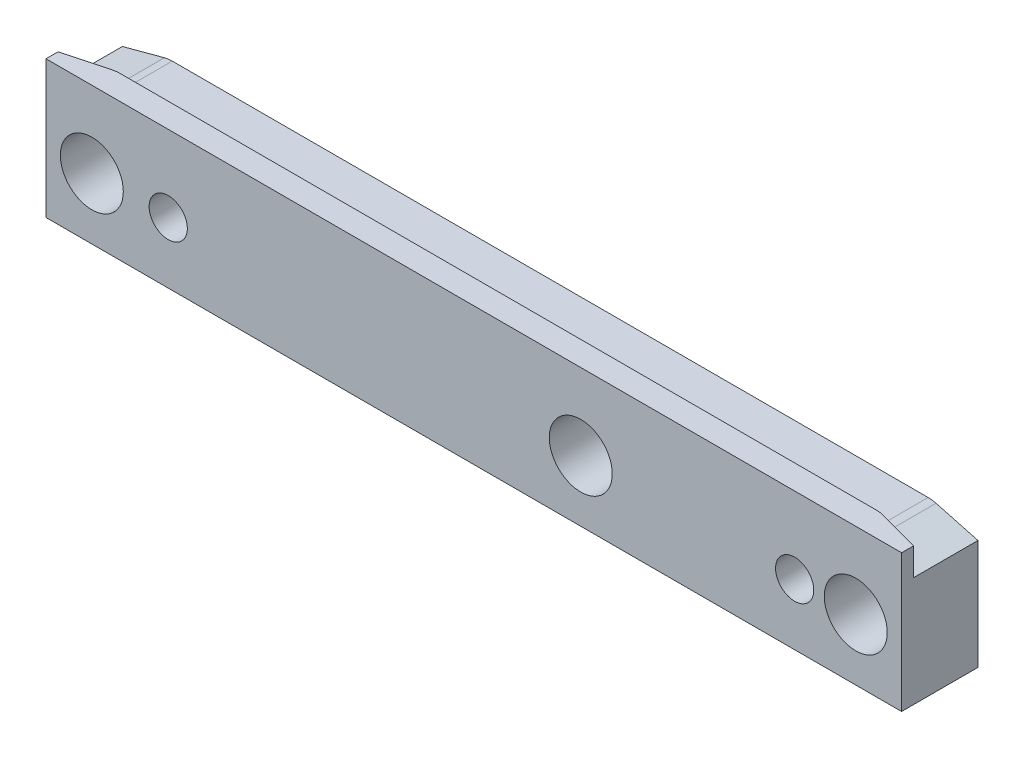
ISO-10303-21;
HEADER;
FILE_DESCRIPTION(('STEP AP214'),'2;1');
FILE_NAME('part.step','',(''),(''),'','','');
FILE_SCHEMA(('AUTOMOTIVE_DESIGN { 1 0 10303 214 1 1 1 1 }'));
ENDSEC;
DATA;
#1=APPLICATION_CONTEXT('core data for automotive mechanical design processes');
#2=APPLICATION_PROTOCOL_DEFINITION('international standard','automotive_design',2000,#1);
#3=PRODUCT_CONTEXT('',#1,'mechanical');
#4=PRODUCT('Part','Part','',(#3));
#5=PRODUCT_RELATED_PRODUCT_CATEGORY('part','',(#4));
#6=PRODUCT_DEFINITION_FORMATION('','',#4);
#7=PRODUCT_DEFINITION_CONTEXT('part definition',#1,'design');
#8=PRODUCT_DEFINITION('design','',#6,#7);
#9=PRODUCT_DEFINITION_SHAPE('','',#8);
#10=(LENGTH_UNIT() NAMED_UNIT(*) SI_UNIT(.MILLI.,.METRE.));
#11=(NAMED_UNIT(*) PLANE_ANGLE_UNIT() SI_UNIT($,.RADIAN.));
#12=(NAMED_UNIT(*) SI_UNIT($,.STERADIAN.) SOLID_ANGLE_UNIT());
#13=UNCERTAINTY_MEASURE_WITH_UNIT(LENGTH_MEASURE(1.E-05),#10,'distance_accuracy_value','');
#14=(GEOMETRIC_REPRESENTATION_CONTEXT(3) GLOBAL_UNCERTAINTY_ASSIGNED_CONTEXT((#13)) GLOBAL_UNIT_ASSIGNED_CONTEXT((#10,
#11,#12)) REPRESENTATION_CONTEXT('',''));
#15=CARTESIAN_POINT('',(0.,0.,0.));
#16=DIRECTION('',(0.,0.,1.));
#17=DIRECTION('',(1.,0.,0.));
#18=AXIS2_PLACEMENT_3D('',#15,#16,#17);
#19=CARTESIAN_POINT('',(-1145.54,-79.450694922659,15.875));
#20=DIRECTION('',(1.,0.,0.));
#21=DIRECTION('',(0.,0.,-1.));
#22=AXIS2_PLACEMENT_3D('',#19,#20,#21);
#23=PLANE('',#22);
#24=DIRECTION('',(0.,0.,-1.));
#25=VECTOR('',#24,1.);
#26=CARTESIAN_POINT('',(-1145.54,-73.7234788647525,15.875));
#27=LINE('',#26,#25);
#28=CARTESIAN_POINT('',(-1145.54,-73.7234788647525,15.875));
#29=VERTEX_POINT('',#28);
#30=CARTESIAN_POINT('',(-1145.54,-73.7234788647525,13.3722160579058));
#31=VERTEX_POINT('',#30);
#32=EDGE_CURVE('E170',#29,#31,#27,.T.);
#33=ORIENTED_EDGE('',*,*,#32,.T.);
#34=DIRECTION('',(0.,-1.,0.));
#35=VECTOR('',#34,1.);
#36=CARTESIAN_POINT('',(-1145.54,-79.450694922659,13.3722160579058));
#37=LINE('',#36,#35);
#38=CARTESIAN_POINT('',(-1145.54,-79.450694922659,13.3722160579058));
#39=VERTEX_POINT('',#38);
#40=EDGE_CURVE('E273',#31,#39,#37,.T.);
#41=ORIENTED_EDGE('',*,*,#40,.T.);
#42=DIRECTION('',(0.,0.,-1.));
#43=VECTOR('',#42,1.);
#44=CARTESIAN_POINT('',(-1145.54,-79.450694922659,15.875));
#45=LINE('',#44,#43);
#46=CARTESIAN_POINT('',(-1145.54,-79.450694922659,0.));
#47=VERTEX_POINT('',#46);
#48=EDGE_CURVE('E165',#39,#47,#45,.T.);
#49=ORIENTED_EDGE('',*,*,#48,.T.);
#50=DIRECTION('',(0.,-1.,0.));
#51=VECTOR('',#50,1.);
#52=CARTESIAN_POINT('',(-1145.54,-79.450694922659,0.));
#53=LINE('',#52,#51);
#54=CARTESIAN_POINT('',(-1145.54,-102.298478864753,0.));
#55=VERTEX_POINT('',#54);
#56=EDGE_CURVE('E184',#47,#55,#53,.T.);
#57=ORIENTED_EDGE('',*,*,#56,.T.);
#58=DIRECTION('',(0.,0.,-1.));
#59=VECTOR('',#58,1.);
#60=CARTESIAN_POINT('',(-1145.54,-102.298478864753,15.875));
#61=LINE('',#60,#59);
#62=CARTESIAN_POINT('',(-1145.54,-102.298478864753,15.875));
#63=VERTEX_POINT('',#62);
#64=EDGE_CURVE('E277',#63,#55,#61,.T.);
#65=ORIENTED_EDGE('',*,*,#64,.F.);
#66=DIRECTION('',(0.,-1.,0.));
#67=VECTOR('',#66,1.);
#68=CARTESIAN_POINT('',(-1145.54,-79.450694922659,15.875));
#69=LINE('',#68,#67);
#70=EDGE_CURVE('E185',#29,#63,#69,.T.);
#71=ORIENTED_EDGE('',*,*,#70,.F.);
#72=EDGE_LOOP('',(#33,#41,#49,#57,#65,#71));
#73=FACE_BOUND('',#72,.T.);
#74=ADVANCED_FACE('F54',(#73),#23,.F.);
#75=CARTESIAN_POINT('',(-967.74,-102.298478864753,15.875));
#76=DIRECTION('',(0.,1.,0.));
#77=DIRECTION('',(-1.,0.,0.));
#78=AXIS2_PLACEMENT_3D('',#75,#76,#77);
#79=PLANE('',#78);
#80=DIRECTION('',(1.,0.,0.));
#81=VECTOR('',#80,1.);
#82=CARTESIAN_POINT('',(-967.74,-102.298478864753,0.));
#83=LINE('',#82,#81);
#84=CARTESIAN_POINT('',(-967.74,-102.298478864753,0.));
#85=VERTEX_POINT('',#84);
#86=EDGE_CURVE('E194',#55,#85,#83,.T.);
#87=ORIENTED_EDGE('',*,*,#86,.T.);
#88=DIRECTION('',(0.,0.,-1.));
#89=VECTOR('',#88,1.);
#90=CARTESIAN_POINT('',(-967.74,-102.298478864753,15.875));
#91=LINE('',#90,#89);
#92=CARTESIAN_POINT('',(-967.74,-102.298478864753,15.875));
#93=VERTEX_POINT('',#92);
#94=EDGE_CURVE('E280',#93,#85,#91,.T.);
#95=ORIENTED_EDGE('',*,*,#94,.F.);
#96=DIRECTION('',(1.,0.,0.));
#97=VECTOR('',#96,1.);
#98=CARTESIAN_POINT('',(-967.74,-102.298478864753,15.875));
#99=LINE('',#98,#97);
#100=EDGE_CURVE('E162',#63,#93,#99,.T.);
#101=ORIENTED_EDGE('',*,*,#100,.F.);
#102=ORIENTED_EDGE('',*,*,#64,.T.);
#103=EDGE_LOOP('',(#87,#95,#101,#102));
#104=FACE_BOUND('',#103,.T.);
#105=ADVANCED_FACE('F333',(#104),#79,.F.);
#106=CARTESIAN_POINT('',(-967.74,-79.450694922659,15.875));
#107=DIRECTION('',(-1.,0.,0.));
#108=DIRECTION('',(0.,0.,1.));
#109=AXIS2_PLACEMENT_3D('',#106,#107,#108);
#110=PLANE('',#109);
#111=DIRECTION('',(0.,0.,-1.));
#112=VECTOR('',#111,1.);
#113=CARTESIAN_POINT('',(-967.74,-79.450694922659,15.875));
#114=LINE('',#113,#112);
#115=CARTESIAN_POINT('',(-967.74,-79.450694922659,13.3722160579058));
#116=VERTEX_POINT('',#115);
#117=CARTESIAN_POINT('',(-967.74,-79.450694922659,0.));
#118=VERTEX_POINT('',#117);
#119=EDGE_CURVE('E283',#116,#118,#114,.T.);
#120=ORIENTED_EDGE('',*,*,#119,.F.);
#121=DIRECTION('',(0.,1.,0.));
#122=VECTOR('',#121,1.);
#123=CARTESIAN_POINT('',(-967.74,-73.7234788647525,13.3722160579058));
#124=LINE('',#123,#122);
#125=CARTESIAN_POINT('',(-967.74,-73.7234788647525,13.3722160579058));
#126=VERTEX_POINT('',#125);
#127=EDGE_CURVE('E151',#116,#126,#124,.T.);
#128=ORIENTED_EDGE('',*,*,#127,.T.);
#129=DIRECTION('',(0.,0.,1.));
#130=VECTOR('',#129,1.);
#131=CARTESIAN_POINT('',(-967.74,-73.7234788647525,15.875));
#132=LINE('',#131,#130);
#133=CARTESIAN_POINT('',(-967.74,-73.7234788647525,15.875));
#134=VERTEX_POINT('',#133);
#135=EDGE_CURVE('E146',#126,#134,#132,.T.);
#136=ORIENTED_EDGE('',*,*,#135,.T.);
#137=DIRECTION('',(0.,1.,0.));
#138=VECTOR('',#137,1.);
#139=CARTESIAN_POINT('',(-967.74,-79.450694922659,15.875));
#140=LINE('',#139,#138);
#141=EDGE_CURVE('E149',#93,#134,#140,.T.);
#142=ORIENTED_EDGE('',*,*,#141,.F.);
#143=ORIENTED_EDGE('',*,*,#94,.T.);
#144=DIRECTION('',(0.,1.,0.));
#145=VECTOR('',#144,1.);
#146=CARTESIAN_POINT('',(-967.74,-79.450694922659,0.));
#147=LINE('',#146,#145);
#148=EDGE_CURVE('E198',#85,#118,#147,.T.);
#149=ORIENTED_EDGE('',*,*,#148,.T.);
#150=EDGE_LOOP('',(#120,#128,#136,#142,#143,#149));
#151=FACE_BOUND('',#150,.T.);
#152=ADVANCED_FACE('F148',(#151),#110,.F.);
#153=CARTESIAN_POINT('',(-967.74,-79.450694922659,15.875));
#154=DIRECTION('',(-0.258819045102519,-0.965925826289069,0.));
#155=DIRECTION('',(0.965925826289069,-0.258819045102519,0.));
#156=AXIS2_PLACEMENT_3D('',#153,#154,#155);
#157=PLANE('',#156);
#158=DIRECTION('',(0.,0.,-1.));
#159=VECTOR('',#158,1.);
#160=CARTESIAN_POINT('',(-976.457492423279,-77.1148498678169,15.875));
#161=LINE('',#160,#159);
#162=CARTESIAN_POINT('',(-976.457492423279,-77.1148498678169,11.0363710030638));
#163=VERTEX_POINT('',#162);
#164=CARTESIAN_POINT('',(-976.457492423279,-77.1148498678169,0.));
#165=VERTEX_POINT('',#164);
#166=EDGE_CURVE('E286',#163,#165,#161,.T.);
#167=ORIENTED_EDGE('',*,*,#166,.F.);
#168=DIRECTION('',(0.93511312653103,-0.25056280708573,0.250562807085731));
#169=VECTOR('',#168,1.);
#170=CARTESIAN_POINT('',(-967.153586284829,-79.6078240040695,13.5293451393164));
#171=LINE('',#170,#169);
#172=EDGE_CURVE('E257',#163,#116,#171,.T.);
#173=ORIENTED_EDGE('',*,*,#172,.T.);
#174=ORIENTED_EDGE('',*,*,#119,.T.);
#175=DIRECTION('',(-0.965925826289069,0.258819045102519,0.));
#176=VECTOR('',#175,1.);
#177=CARTESIAN_POINT('',(-967.74,-79.450694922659,0.));
#178=LINE('',#177,#176);
#179=EDGE_CURVE('E202',#118,#165,#178,.T.);
#180=ORIENTED_EDGE('',*,*,#179,.T.);
#181=EDGE_LOOP('',(#167,#173,#174,#180));
#182=FACE_BOUND('',#181,.T.);
#183=ADVANCED_FACE('F331',(#182),#157,.F.);
#184=CARTESIAN_POINT('',(-978.10099335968,-83.2484788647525,15.875));
#185=DIRECTION('',(0.,0.,-1.));
#186=DIRECTION('',(-1.,0.,0.));
#187=AXIS2_PLACEMENT_3D('',#184,#185,#186);
#188=CYLINDRICAL_SURFACE('',#187,6.34999999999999);
#189=DIRECTION('',(0.,0.,-1.));
#190=VECTOR('',#189,1.);
#191=CARTESIAN_POINT('',(-978.10099335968,-76.8984788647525,15.875));
#192=LINE('',#191,#190);
#193=CARTESIAN_POINT('',(-978.10099335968,-76.8984788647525,10.8199999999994));
#194=VERTEX_POINT('',#193);
#195=CARTESIAN_POINT('',(-978.10099335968,-76.8984788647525,0.));
#196=VERTEX_POINT('',#195);
#197=EDGE_CURVE('E288',#194,#196,#192,.T.);
#198=ORIENTED_EDGE('',*,*,#197,.F.);
#199=CARTESIAN_POINT('',(-978.10099335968,-83.2484788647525,17.1699999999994));
#200=DIRECTION('',(0.,-0.707106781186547,-0.707106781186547));
#201=DIRECTION('',(0.,0.707106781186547,-0.707106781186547));
#202=AXIS2_PLACEMENT_3D('',#199,#200,#201);
#203=ELLIPSE('',#202,8.98025612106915,6.35);
#204=EDGE_CURVE('E12',#194,#163,#203,.T.);
#205=ORIENTED_EDGE('',*,*,#204,.T.);
#206=ORIENTED_EDGE('',*,*,#166,.T.);
#207=CARTESIAN_POINT('',(-978.10099335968,-83.2484788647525,0.));
#208=DIRECTION('',(0.,0.,1.));
#209=DIRECTION('',(1.,0.,0.));
#210=AXIS2_PLACEMENT_3D('',#207,#208,#209);
#211=CIRCLE('',#210,6.34999999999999);
#212=EDGE_CURVE('E206',#165,#196,#211,.T.);
#213=ORIENTED_EDGE('',*,*,#212,.T.);
#214=EDGE_LOOP('',(#198,#205,#206,#213));
#215=FACE_BOUND('',#214,.T.);
#216=ADVANCED_FACE('F326',(#215),#188,.T.);
#217=CARTESIAN_POINT('',(-978.10099335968,-76.8984788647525,15.875));
#218=DIRECTION('',(0.,-1.,0.));
#219=DIRECTION('',(0.,0.,-1.));
#220=AXIS2_PLACEMENT_3D('',#217,#218,#219);
#221=PLANE('',#220);
#222=DIRECTION('',(0.,0.,-1.));
#223=VECTOR('',#222,1.);
#224=CARTESIAN_POINT('',(-1135.17900664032,-76.8984788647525,15.875));
#225=LINE('',#224,#223);
#226=CARTESIAN_POINT('',(-1135.17900664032,-76.8984788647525,10.8199999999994));
#227=VERTEX_POINT('',#226);
#228=CARTESIAN_POINT('',(-1135.17900664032,-76.8984788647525,0.));
#229=VERTEX_POINT('',#228);
#230=EDGE_CURVE('E227',#227,#229,#225,.T.);
#231=ORIENTED_EDGE('',*,*,#230,.F.);
#232=DIRECTION('',(1.,0.,0.));
#233=VECTOR('',#232,1.);
#234=CARTESIAN_POINT('',(-978.10099335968,-76.8984788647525,10.8199999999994));
#235=LINE('',#234,#233);
#236=EDGE_CURVE('E176',#227,#194,#235,.T.);
#237=ORIENTED_EDGE('',*,*,#236,.T.);
#238=ORIENTED_EDGE('',*,*,#197,.T.);
#239=DIRECTION('',(-1.,0.,0.));
#240=VECTOR('',#239,1.);
#241=CARTESIAN_POINT('',(-978.10099335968,-76.8984788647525,0.));
#242=LINE('',#241,#240);
#243=EDGE_CURVE('E210',#196,#229,#242,.T.);
#244=ORIENTED_EDGE('',*,*,#243,.T.);
#245=EDGE_LOOP('',(#231,#237,#238,#244));
#246=FACE_BOUND('',#245,.T.);
#247=ADVANCED_FACE('F306',(#246),#221,.F.);
#248=CARTESIAN_POINT('',(-1135.17900664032,-83.2484788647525,15.875));
#249=DIRECTION('',(0.,0.,-1.));
#250=DIRECTION('',(-1.,0.,0.));
#251=AXIS2_PLACEMENT_3D('',#248,#249,#250);
#252=CYLINDRICAL_SURFACE('',#251,6.35000000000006);
#253=DIRECTION('',(0.,0.,-1.));
#254=VECTOR('',#253,1.);
#255=CARTESIAN_POINT('',(-1136.82250757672,-77.1148498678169,15.875));
#256=LINE('',#255,#254);
#257=CARTESIAN_POINT('',(-1136.82250757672,-77.1148498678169,11.0363710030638));
#258=VERTEX_POINT('',#257);
#259=CARTESIAN_POINT('',(-1136.82250757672,-77.1148498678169,0.));
#260=VERTEX_POINT('',#259);
#261=EDGE_CURVE('E223',#258,#260,#256,.T.);
#262=ORIENTED_EDGE('',*,*,#261,.F.);
#263=CARTESIAN_POINT('',(-1135.17900664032,-83.2484788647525,17.1699999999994));
#264=DIRECTION('',(0.,-0.707106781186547,-0.707106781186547));
#265=DIRECTION('',(0.,0.707106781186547,-0.707106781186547));
#266=AXIS2_PLACEMENT_3D('',#263,#264,#265);
#267=ELLIPSE('',#266,8.98025612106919,6.35000000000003);
#268=EDGE_CURVE('E64',#258,#227,#267,.T.);
#269=ORIENTED_EDGE('',*,*,#268,.T.);
#270=ORIENTED_EDGE('',*,*,#230,.T.);
#271=CARTESIAN_POINT('',(-1135.17900664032,-83.2484788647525,0.));
#272=DIRECTION('',(0.,0.,1.));
#273=DIRECTION('',(-1.,0.,0.));
#274=AXIS2_PLACEMENT_3D('',#271,#272,#273);
#275=CIRCLE('',#274,6.35000000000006);
#276=EDGE_CURVE('E214',#229,#260,#275,.T.);
#277=ORIENTED_EDGE('',*,*,#276,.T.);
#278=EDGE_LOOP('',(#262,#269,#270,#277));
#279=FACE_BOUND('',#278,.T.);
#280=ADVANCED_FACE('F299',(#279),#252,.T.);
#281=CARTESIAN_POINT('',(-1136.82250757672,-77.1148498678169,15.875));
#282=DIRECTION('',(0.258819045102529,-0.965925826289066,0.));
#283=DIRECTION('',(0.965925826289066,0.258819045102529,0.));
#284=AXIS2_PLACEMENT_3D('',#281,#282,#283);
#285=PLANE('',#284);
#286=ORIENTED_EDGE('',*,*,#48,.F.);
#287=DIRECTION('',(0.935113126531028,0.250562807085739,-0.250562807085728));
#288=VECTOR('',#287,1.);
#289=CARTESIAN_POINT('',(-1137.95622046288,-77.4186273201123,11.3401484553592));
#290=LINE('',#289,#288);
#291=EDGE_CURVE('E261',#39,#258,#290,.T.);
#292=ORIENTED_EDGE('',*,*,#291,.T.);
#293=ORIENTED_EDGE('',*,*,#261,.T.);
#294=DIRECTION('',(-0.965925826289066,-0.258819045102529,0.));
#295=VECTOR('',#294,1.);
#296=CARTESIAN_POINT('',(-1136.82250757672,-77.1148498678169,0.));
#297=LINE('',#296,#295);
#298=EDGE_CURVE('E188',#260,#47,#297,.T.);
#299=ORIENTED_EDGE('',*,*,#298,.T.);
#300=EDGE_LOOP('',(#286,#292,#293,#299));
#301=FACE_BOUND('',#300,.T.);
#302=ADVANCED_FACE('F313',(#301),#285,.F.);
#303=CARTESIAN_POINT('',(-978.10099335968,-83.2484788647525,15.875));
#304=DIRECTION('',(0.,0.,1.));
#305=DIRECTION('',(1.,0.,0.));
#306=AXIS2_PLACEMENT_3D('',#303,#304,#305);
#307=PLANE('',#306);
#308=CARTESIAN_POINT('',(-1136.015,-89.5984788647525,15.875));
#309=DIRECTION('',(0.,0.,1.));
#310=DIRECTION('',(1.,0.,0.));
#311=AXIS2_PLACEMENT_3D('',#308,#309,#310);
#312=CIRCLE('',#311,6.54050000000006);
#313=CARTESIAN_POINT('',(-1129.4745,-89.5984788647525,15.875));
#314=VERTEX_POINT('',#313);
#315=EDGE_CURVE('E432',#314,#314,#312,.T.);
#316=ORIENTED_EDGE('',*,*,#315,.F.);
#317=EDGE_LOOP('',(#316));
#318=FACE_BOUND('',#317,.T.);
#319=CARTESIAN_POINT('',(-1034.415,-89.5984788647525,15.875));
#320=DIRECTION('',(0.,0.,1.));
#321=DIRECTION('',(1.,0.,0.));
#322=AXIS2_PLACEMENT_3D('',#319,#320,#321);
#323=CIRCLE('',#322,6.54050000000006);
#324=CARTESIAN_POINT('',(-1027.8745,-89.5984788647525,15.875));
#325=VERTEX_POINT('',#324);
#326=EDGE_CURVE('E459',#325,#325,#323,.T.);
#327=ORIENTED_EDGE('',*,*,#326,.F.);
#328=EDGE_LOOP('',(#327));
#329=FACE_BOUND('',#328,.T.);
#330=CARTESIAN_POINT('',(-977.265,-89.5984788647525,15.875));
#331=DIRECTION('',(0.,0.,1.));
#332=DIRECTION('',(1.,0.,0.));
#333=AXIS2_PLACEMENT_3D('',#330,#331,#332);
#334=CIRCLE('',#333,6.54049999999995);
#335=CARTESIAN_POINT('',(-970.7245,-89.5984788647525,15.875));
#336=VERTEX_POINT('',#335);
#337=EDGE_CURVE('E479',#336,#336,#334,.T.);
#338=ORIENTED_EDGE('',*,*,#337,.F.);
#339=EDGE_LOOP('',(#338));
#340=FACE_BOUND('',#339,.T.);
#341=CARTESIAN_POINT('',(-1120.14,-89.5984788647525,15.875));
#342=DIRECTION('',(0.,0.,-1.));
#343=DIRECTION('',(-1.,0.,0.));
#344=AXIS2_PLACEMENT_3D('',#341,#342,#343);
#345=CIRCLE('',#344,3.96875000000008);
#346=CARTESIAN_POINT('',(-1124.10875,-89.5984788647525,15.875));
#347=VERTEX_POINT('',#346);
#348=EDGE_CURVE('E493',#347,#347,#345,.T.);
#349=ORIENTED_EDGE('',*,*,#348,.T.);
#350=EDGE_LOOP('',(#349));
#351=FACE_BOUND('',#350,.T.);
#352=CARTESIAN_POINT('',(-989.965,-89.5984788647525,15.875));
#353=DIRECTION('',(0.,0.,-1.));
#354=DIRECTION('',(-1.,0.,0.));
#355=AXIS2_PLACEMENT_3D('',#352,#353,#354);
#356=CIRCLE('',#355,3.96874999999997);
#357=CARTESIAN_POINT('',(-993.93375,-89.5984788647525,15.875));
#358=VERTEX_POINT('',#357);
#359=EDGE_CURVE('E492',#358,#358,#356,.T.);
#360=ORIENTED_EDGE('',*,*,#359,.T.);
#361=EDGE_LOOP('',(#360));
#362=FACE_BOUND('',#361,.T.);
#363=ORIENTED_EDGE('',*,*,#70,.T.);
#364=ORIENTED_EDGE('',*,*,#100,.T.);
#365=ORIENTED_EDGE('',*,*,#141,.T.);
#366=DIRECTION('',(1.,0.,0.));
#367=VECTOR('',#366,1.);
#368=CARTESIAN_POINT('',(-1174.55867760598,-73.7234788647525,15.875));
#369=LINE('',#368,#367);
#370=EDGE_CURVE('E161',#29,#134,#369,.T.);
#371=ORIENTED_EDGE('',*,*,#370,.F.);
#372=EDGE_LOOP('',(#363,#364,#365,#371));
#373=FACE_BOUND('',#372,.T.);
#374=ADVANCED_FACE('F160',(#318,#329,#340,#351,#362,#373),#307,.T.);
#375=CARTESIAN_POINT('',(-978.10099335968,-83.2484788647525,0.));
#376=DIRECTION('',(0.,0.,1.));
#377=DIRECTION('',(1.,0.,0.));
#378=AXIS2_PLACEMENT_3D('',#375,#376,#377);
#379=PLANE('',#378);
#380=CARTESIAN_POINT('',(-1136.015,-89.5984788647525,0.));
#381=DIRECTION('',(0.,0.,1.));
#382=DIRECTION('',(1.,0.,0.));
#383=AXIS2_PLACEMENT_3D('',#380,#381,#382);
#384=CIRCLE('',#383,4.36879999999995);
#385=CARTESIAN_POINT('',(-1131.6462,-89.5984788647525,0.));
#386=VERTEX_POINT('',#385);
#387=EDGE_CURVE('E422',#386,#386,#384,.T.);
#388=ORIENTED_EDGE('',*,*,#387,.T.);
#389=EDGE_LOOP('',(#388));
#390=FACE_BOUND('',#389,.T.);
#391=CARTESIAN_POINT('',(-1034.415,-89.5984788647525,0.));
#392=DIRECTION('',(0.,0.,1.));
#393=DIRECTION('',(1.,0.,0.));
#394=AXIS2_PLACEMENT_3D('',#391,#392,#393);
#395=CIRCLE('',#394,4.36879999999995);
#396=CARTESIAN_POINT('',(-1030.0462,-89.5984788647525,0.));
#397=VERTEX_POINT('',#396);
#398=EDGE_CURVE('E453',#397,#397,#395,.T.);
#399=ORIENTED_EDGE('',*,*,#398,.T.);
#400=EDGE_LOOP('',(#399));
#401=FACE_BOUND('',#400,.T.);
#402=CARTESIAN_POINT('',(-977.265,-89.5984788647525,0.));
#403=DIRECTION('',(0.,0.,1.));
#404=DIRECTION('',(1.,0.,0.));
#405=AXIS2_PLACEMENT_3D('',#402,#403,#404);
#406=CIRCLE('',#405,4.36879999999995);
#407=CARTESIAN_POINT('',(-972.8962,-89.5984788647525,0.));
#408=VERTEX_POINT('',#407);
#409=EDGE_CURVE('E473',#408,#408,#406,.T.);
#410=ORIENTED_EDGE('',*,*,#409,.T.);
#411=EDGE_LOOP('',(#410));
#412=FACE_BOUND('',#411,.T.);
#413=CARTESIAN_POINT('',(-1120.14,-89.5984788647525,0.));
#414=DIRECTION('',(0.,0.,-1.));
#415=DIRECTION('',(-1.,0.,0.));
#416=AXIS2_PLACEMENT_3D('',#413,#414,#415);
#417=CIRCLE('',#416,3.96875000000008);
#418=CARTESIAN_POINT('',(-1124.10875,-89.5984788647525,0.));
#419=VERTEX_POINT('',#418);
#420=EDGE_CURVE('E487',#419,#419,#417,.T.);
#421=ORIENTED_EDGE('',*,*,#420,.F.);
#422=EDGE_LOOP('',(#421));
#423=FACE_BOUND('',#422,.T.);
#424=CARTESIAN_POINT('',(-989.965,-89.5984788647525,0.));
#425=DIRECTION('',(0.,0.,-1.));
#426=DIRECTION('',(-1.,0.,0.));
#427=AXIS2_PLACEMENT_3D('',#424,#425,#426);
#428=CIRCLE('',#427,3.96874999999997);
#429=CARTESIAN_POINT('',(-993.93375,-89.5984788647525,0.));
#430=VERTEX_POINT('',#429);
#431=EDGE_CURVE('E155',#430,#430,#428,.T.);
#432=ORIENTED_EDGE('',*,*,#431,.F.);
#433=EDGE_LOOP('',(#432));
#434=FACE_BOUND('',#433,.T.);
#435=ORIENTED_EDGE('',*,*,#56,.F.);
#436=ORIENTED_EDGE('',*,*,#298,.F.);
#437=ORIENTED_EDGE('',*,*,#276,.F.);
#438=ORIENTED_EDGE('',*,*,#243,.F.);
#439=ORIENTED_EDGE('',*,*,#212,.F.);
#440=ORIENTED_EDGE('',*,*,#179,.F.);
#441=ORIENTED_EDGE('',*,*,#148,.F.);
#442=ORIENTED_EDGE('',*,*,#86,.F.);
#443=EDGE_LOOP('',(#435,#436,#437,#438,#439,#440,#441,#442));
#444=FACE_BOUND('',#443,.T.);
#445=ADVANCED_FACE('F310',(#390,#401,#412,#423,#434,#444),#379,.F.);
#446=CARTESIAN_POINT('',(-1174.55867760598,-102.298478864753,10.8199999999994));
#447=DIRECTION('',(0.,0.,-1.));
#448=DIRECTION('',(-1.,0.,0.));
#449=AXIS2_PLACEMENT_3D('',#446,#447,#448);
#450=PLANE('',#449);
#451=ORIENTED_EDGE('',*,*,#236,.F.);
#452=DIRECTION('',(0.,1.,0.));
#453=VECTOR('',#452,1.);
#454=CARTESIAN_POINT('',(-1135.17900664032,-102.298478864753,10.8199999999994));
#455=LINE('',#454,#453);
#456=CARTESIAN_POINT('',(-1135.17900664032,-73.7234788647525,10.8199999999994));
#457=VERTEX_POINT('',#456);
#458=EDGE_CURVE('E249',#227,#457,#455,.T.);
#459=ORIENTED_EDGE('',*,*,#458,.T.);
#460=DIRECTION('',(1.,0.,0.));
#461=VECTOR('',#460,1.);
#462=CARTESIAN_POINT('',(-1174.55867760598,-73.7234788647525,10.8199999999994));
#463=LINE('',#462,#461);
#464=CARTESIAN_POINT('',(-978.10099335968,-73.7234788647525,10.8199999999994));
#465=VERTEX_POINT('',#464);
#466=EDGE_CURVE('E154',#457,#465,#463,.T.);
#467=ORIENTED_EDGE('',*,*,#466,.T.);
#468=DIRECTION('',(0.,-1.,0.));
#469=VECTOR('',#468,1.);
#470=CARTESIAN_POINT('',(-978.10099335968,-102.298478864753,10.8199999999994));
#471=LINE('',#470,#469);
#472=EDGE_CURVE('E253',#465,#194,#471,.T.);
#473=ORIENTED_EDGE('',*,*,#472,.T.);
#474=EDGE_LOOP('',(#451,#459,#467,#473));
#475=FACE_BOUND('',#474,.T.);
#476=ADVANCED_FACE('F321',(#475),#450,.T.);
#477=CARTESIAN_POINT('',(-1174.55867760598,-73.7234788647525,15.875));
#478=DIRECTION('',(0.,1.,0.));
#479=DIRECTION('',(0.,0.,1.));
#480=AXIS2_PLACEMENT_3D('',#477,#478,#479);
#481=PLANE('',#480);
#482=ORIENTED_EDGE('',*,*,#466,.F.);
#483=CARTESIAN_POINT('',(-1135.17900664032,-73.7234788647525,17.1699999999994));
#484=DIRECTION('',(0.,1.,0.));
#485=DIRECTION('',(0.,0.,1.));
#486=AXIS2_PLACEMENT_3D('',#483,#484,#485);
#487=CIRCLE('',#486,6.35);
#488=CARTESIAN_POINT('',(-1136.82250757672,-73.7234788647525,11.0363710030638));
#489=VERTEX_POINT('',#488);
#490=EDGE_CURVE('E79',#457,#489,#487,.T.);
#491=ORIENTED_EDGE('',*,*,#490,.T.);
#492=DIRECTION('',(-0.965925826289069,0.,0.258819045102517));
#493=VECTOR('',#492,1.);
#494=CARTESIAN_POINT('',(-1173.24049078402,-73.7234788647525,20.7945401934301));
#495=LINE('',#494,#493);
#496=EDGE_CURVE('E267',#489,#31,#495,.T.);
#497=ORIENTED_EDGE('',*,*,#496,.T.);
#498=ORIENTED_EDGE('',*,*,#32,.F.);
#499=ORIENTED_EDGE('',*,*,#370,.T.);
#500=ORIENTED_EDGE('',*,*,#135,.F.);
#501=DIRECTION('',(-0.965925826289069,0.,-0.25881904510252));
#502=VECTOR('',#501,1.);
#503=CARTESIAN_POINT('',(-1160.07875720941,-73.7234788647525,-38.1647986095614));
#504=LINE('',#503,#502);
#505=CARTESIAN_POINT('',(-976.457492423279,-73.7234788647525,11.0363710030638));
#506=VERTEX_POINT('',#505);
#507=EDGE_CURVE('E270',#126,#506,#504,.T.);
#508=ORIENTED_EDGE('',*,*,#507,.T.);
#509=CARTESIAN_POINT('',(-978.10099335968,-73.7234788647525,17.1699999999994));
#510=DIRECTION('',(0.,1.,0.));
#511=DIRECTION('',(0.,0.,1.));
#512=AXIS2_PLACEMENT_3D('',#509,#510,#511);
#513=CIRCLE('',#512,6.35);
#514=EDGE_CURVE('E245',#506,#465,#513,.T.);
#515=ORIENTED_EDGE('',*,*,#514,.T.);
#516=EDGE_LOOP('',(#482,#491,#497,#498,#499,#500,#508,#515));
#517=FACE_BOUND('',#516,.T.);
#518=ADVANCED_FACE('F168',(#517),#481,.T.);
#519=CARTESIAN_POINT('',(-1145.54,-79.450694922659,13.3722160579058));
#520=DIRECTION('',(-0.258819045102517,0.,-0.965925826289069));
#521=DIRECTION('',(0.,1.,0.));
#522=AXIS2_PLACEMENT_3D('',#519,#520,#521);
#523=PLANE('',#522);
#524=ORIENTED_EDGE('',*,*,#496,.F.);
#525=DIRECTION('',(0.,1.,0.));
#526=VECTOR('',#525,1.);
#527=CARTESIAN_POINT('',(-1136.82250757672,-79.450694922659,11.0363710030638));
#528=LINE('',#527,#526);
#529=EDGE_CURVE('E241',#489,#258,#528,.F.);
#530=ORIENTED_EDGE('',*,*,#529,.T.);
#531=ORIENTED_EDGE('',*,*,#291,.F.);
#532=ORIENTED_EDGE('',*,*,#40,.F.);
#533=EDGE_LOOP('',(#524,#530,#531,#532));
#534=FACE_BOUND('',#533,.T.);
#535=ADVANCED_FACE('F336',(#534),#523,.T.);
#536=CARTESIAN_POINT('',(-967.74,-79.450694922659,13.3722160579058));
#537=DIRECTION('',(0.25881904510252,0.,-0.965925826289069));
#538=DIRECTION('',(0.,-1.,0.));
#539=AXIS2_PLACEMENT_3D('',#536,#537,#538);
#540=PLANE('',#539);
#541=ORIENTED_EDGE('',*,*,#172,.F.);
#542=DIRECTION('',(0.,-1.,0.));
#543=VECTOR('',#542,1.);
#544=CARTESIAN_POINT('',(-976.457492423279,-79.450694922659,11.0363710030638));
#545=LINE('',#544,#543);
#546=EDGE_CURVE('E71',#163,#506,#545,.F.);
#547=ORIENTED_EDGE('',*,*,#546,.T.);
#548=ORIENTED_EDGE('',*,*,#507,.F.);
#549=ORIENTED_EDGE('',*,*,#127,.F.);
#550=EDGE_LOOP('',(#541,#547,#548,#549));
#551=FACE_BOUND('',#550,.T.);
#552=ADVANCED_FACE('F338',(#551),#540,.T.);
#553=CARTESIAN_POINT('',(-1135.17900664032,-102.298478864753,17.1699999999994));
#554=DIRECTION('',(0.,1.,0.));
#555=DIRECTION('',(0.,0.,1.));
#556=AXIS2_PLACEMENT_3D('',#553,#554,#555);
#557=CYLINDRICAL_SURFACE('',#556,6.35);
#558=ORIENTED_EDGE('',*,*,#268,.F.);
#559=ORIENTED_EDGE('',*,*,#529,.F.);
#560=ORIENTED_EDGE('',*,*,#490,.F.);
#561=ORIENTED_EDGE('',*,*,#458,.F.);
#562=EDGE_LOOP('',(#558,#559,#560,#561));
#563=FACE_BOUND('',#562,.T.);
#564=ADVANCED_FACE('F319',(#563),#557,.T.);
#565=CARTESIAN_POINT('',(-978.10099335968,-102.298478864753,17.1699999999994));
#566=DIRECTION('',(0.,-1.,0.));
#567=DIRECTION('',(0.,0.,-1.));
#568=AXIS2_PLACEMENT_3D('',#565,#566,#567);
#569=CYLINDRICAL_SURFACE('',#568,6.35);
#570=ORIENTED_EDGE('',*,*,#514,.F.);
#571=ORIENTED_EDGE('',*,*,#546,.F.);
#572=ORIENTED_EDGE('',*,*,#204,.F.);
#573=ORIENTED_EDGE('',*,*,#472,.F.);
#574=EDGE_LOOP('',(#570,#571,#572,#573));
#575=FACE_BOUND('',#574,.T.);
#576=ADVANCED_FACE('F56',(#575),#569,.T.);
#577=CARTESIAN_POINT('',(-989.965,-89.5984788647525,0.));
#578=DIRECTION('',(0.,0.,-1.));
#579=DIRECTION('',(-1.,0.,0.));
#580=AXIS2_PLACEMENT_3D('',#577,#578,#579);
#581=CYLINDRICAL_SURFACE('',#580,3.96874999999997);
#582=ORIENTED_EDGE('',*,*,#359,.F.);
#583=EDGE_LOOP('',(#582));
#584=FACE_BOUND('',#583,.T.);
#585=ORIENTED_EDGE('',*,*,#431,.T.);
#586=EDGE_LOOP('',(#585));
#587=FACE_BOUND('',#586,.T.);
#588=ADVANCED_FACE('F374',(#584,#587),#581,.F.);
#589=CARTESIAN_POINT('',(-1120.14,-89.5984788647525,0.));
#590=DIRECTION('',(0.,0.,-1.));
#591=DIRECTION('',(-1.,0.,0.));
#592=AXIS2_PLACEMENT_3D('',#589,#590,#591);
#593=CYLINDRICAL_SURFACE('',#592,3.96875000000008);
#594=ORIENTED_EDGE('',*,*,#348,.F.);
#595=EDGE_LOOP('',(#594));
#596=FACE_BOUND('',#595,.T.);
#597=ORIENTED_EDGE('',*,*,#420,.T.);
#598=EDGE_LOOP('',(#597));
#599=FACE_BOUND('',#598,.T.);
#600=ADVANCED_FACE('F377',(#596,#599),#593,.F.);
#601=CARTESIAN_POINT('',(-977.265,-89.5984788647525,15.875));
#602=DIRECTION('',(0.,0.,1.));
#603=DIRECTION('',(1.,0.,0.));
#604=AXIS2_PLACEMENT_3D('',#601,#602,#603);
#605=CYLINDRICAL_SURFACE('',#604,6.54049999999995);
#606=CARTESIAN_POINT('',(-977.265,-89.5984788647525,6.223));
#607=DIRECTION('',(0.,0.,1.));
#608=DIRECTION('',(1.,0.,0.));
#609=AXIS2_PLACEMENT_3D('',#606,#607,#608);
#610=CIRCLE('',#609,6.54049999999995);
#611=CARTESIAN_POINT('',(-970.7245,-89.5984788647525,6.223));
#612=VERTEX_POINT('',#611);
#613=EDGE_CURVE('E472',#612,#612,#610,.T.);
#614=ORIENTED_EDGE('',*,*,#613,.F.);
#615=EDGE_LOOP('',(#614));
#616=FACE_BOUND('',#615,.T.);
#617=ORIENTED_EDGE('',*,*,#337,.T.);
#618=EDGE_LOOP('',(#617));
#619=FACE_BOUND('',#618,.T.);
#620=ADVANCED_FACE('F381',(#616,#619),#605,.F.);
#621=CARTESIAN_POINT('',(-972.8962,-89.5984788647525,6.223));
#622=DIRECTION('',(0.,0.,-1.));
#623=DIRECTION('',(-1.,0.,0.));
#624=AXIS2_PLACEMENT_3D('',#621,#622,#623);
#625=PLANE('',#624);
#626=CARTESIAN_POINT('',(-977.265,-89.5984788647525,6.223));
#627=DIRECTION('',(0.,0.,1.));
#628=DIRECTION('',(1.,0.,0.));
#629=AXIS2_PLACEMENT_3D('',#626,#627,#628);
#630=CIRCLE('',#629,4.36879999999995);
#631=CARTESIAN_POINT('',(-972.8962,-89.5984788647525,6.223));
#632=VERTEX_POINT('',#631);
#633=EDGE_CURVE('E467',#632,#632,#630,.T.);
#634=ORIENTED_EDGE('',*,*,#633,.F.);
#635=EDGE_LOOP('',(#634));
#636=FACE_BOUND('',#635,.T.);
#637=ORIENTED_EDGE('',*,*,#613,.T.);
#638=EDGE_LOOP('',(#637));
#639=FACE_BOUND('',#638,.T.);
#640=ADVANCED_FACE('F385',(#636,#639),#625,.F.);
#641=CARTESIAN_POINT('',(-977.265,-89.5984788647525,15.875));
#642=DIRECTION('',(0.,0.,1.));
#643=DIRECTION('',(1.,0.,0.));
#644=AXIS2_PLACEMENT_3D('',#641,#642,#643);
#645=CYLINDRICAL_SURFACE('',#644,4.36879999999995);
#646=ORIENTED_EDGE('',*,*,#409,.F.);
#647=EDGE_LOOP('',(#646));
#648=FACE_BOUND('',#647,.T.);
#649=ORIENTED_EDGE('',*,*,#633,.T.);
#650=EDGE_LOOP('',(#649));
#651=FACE_BOUND('',#650,.T.);
#652=ADVANCED_FACE('F389',(#648,#651),#645,.F.);
#653=CARTESIAN_POINT('',(-1034.415,-89.5984788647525,15.875));
#654=DIRECTION('',(0.,0.,1.));
#655=DIRECTION('',(1.,0.,0.));
#656=AXIS2_PLACEMENT_3D('',#653,#654,#655);
#657=CYLINDRICAL_SURFACE('',#656,6.54050000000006);
#658=CARTESIAN_POINT('',(-1034.415,-89.5984788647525,6.223));
#659=DIRECTION('',(0.,0.,1.));
#660=DIRECTION('',(1.,0.,0.));
#661=AXIS2_PLACEMENT_3D('',#658,#659,#660);
#662=CIRCLE('',#661,6.54050000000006);
#663=CARTESIAN_POINT('',(-1027.8745,-89.5984788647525,6.223));
#664=VERTEX_POINT('',#663);
#665=EDGE_CURVE('E452',#664,#664,#662,.T.);
#666=ORIENTED_EDGE('',*,*,#665,.F.);
#667=EDGE_LOOP('',(#666));
#668=FACE_BOUND('',#667,.T.);
#669=ORIENTED_EDGE('',*,*,#326,.T.);
#670=EDGE_LOOP('',(#669));
#671=FACE_BOUND('',#670,.T.);
#672=ADVANCED_FACE('F393',(#668,#671),#657,.F.);
#673=CARTESIAN_POINT('',(-1030.0462,-89.5984788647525,6.223));
#674=DIRECTION('',(0.,0.,-1.));
#675=DIRECTION('',(-1.,0.,0.));
#676=AXIS2_PLACEMENT_3D('',#673,#674,#675);
#677=PLANE('',#676);
#678=CARTESIAN_POINT('',(-1034.415,-89.5984788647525,6.223));
#679=DIRECTION('',(0.,0.,1.));
#680=DIRECTION('',(1.,0.,0.));
#681=AXIS2_PLACEMENT_3D('',#678,#679,#680);
#682=CIRCLE('',#681,4.36879999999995);
#683=CARTESIAN_POINT('',(-1030.0462,-89.5984788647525,6.223));
#684=VERTEX_POINT('',#683);
#685=EDGE_CURVE('E447',#684,#684,#682,.T.);
#686=ORIENTED_EDGE('',*,*,#685,.F.);
#687=EDGE_LOOP('',(#686));
#688=FACE_BOUND('',#687,.T.);
#689=ORIENTED_EDGE('',*,*,#665,.T.);
#690=EDGE_LOOP('',(#689));
#691=FACE_BOUND('',#690,.T.);
#692=ADVANCED_FACE('F397',(#688,#691),#677,.F.);
#693=CARTESIAN_POINT('',(-1034.415,-89.5984788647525,15.875));
#694=DIRECTION('',(0.,0.,1.));
#695=DIRECTION('',(1.,0.,0.));
#696=AXIS2_PLACEMENT_3D('',#693,#694,#695);
#697=CYLINDRICAL_SURFACE('',#696,4.36879999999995);
#698=ORIENTED_EDGE('',*,*,#398,.F.);
#699=EDGE_LOOP('',(#698));
#700=FACE_BOUND('',#699,.T.);
#701=ORIENTED_EDGE('',*,*,#685,.T.);
#702=EDGE_LOOP('',(#701));
#703=FACE_BOUND('',#702,.T.);
#704=ADVANCED_FACE('F401',(#700,#703),#697,.F.);
#705=CARTESIAN_POINT('',(-1136.015,-89.5984788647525,15.875));
#706=DIRECTION('',(0.,0.,1.));
#707=DIRECTION('',(1.,0.,0.));
#708=AXIS2_PLACEMENT_3D('',#705,#706,#707);
#709=CYLINDRICAL_SURFACE('',#708,6.54050000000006);
#710=CARTESIAN_POINT('',(-1136.015,-89.5984788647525,6.223));
#711=DIRECTION('',(0.,0.,1.));
#712=DIRECTION('',(1.,0.,0.));
#713=AXIS2_PLACEMENT_3D('',#710,#711,#712);
#714=CIRCLE('',#713,6.54050000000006);
#715=CARTESIAN_POINT('',(-1129.4745,-89.5984788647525,6.223));
#716=VERTEX_POINT('',#715);
#717=EDGE_CURVE('E427',#716,#716,#714,.T.);
#718=ORIENTED_EDGE('',*,*,#717,.F.);
#719=EDGE_LOOP('',(#718));
#720=FACE_BOUND('',#719,.T.);
#721=ORIENTED_EDGE('',*,*,#315,.T.);
#722=EDGE_LOOP('',(#721));
#723=FACE_BOUND('',#722,.T.);
#724=ADVANCED_FACE('F405',(#720,#723),#709,.F.);
#725=CARTESIAN_POINT('',(-1131.6462,-89.5984788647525,6.223));
#726=DIRECTION('',(0.,0.,-1.));
#727=DIRECTION('',(-1.,0.,0.));
#728=AXIS2_PLACEMENT_3D('',#725,#726,#727);
#729=PLANE('',#728);
#730=CARTESIAN_POINT('',(-1136.015,-89.5984788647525,6.223));
#731=DIRECTION('',(0.,0.,1.));
#732=DIRECTION('',(1.,0.,0.));
#733=AXIS2_PLACEMENT_3D('',#730,#731,#732);
#734=CIRCLE('',#733,4.36879999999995);
#735=CARTESIAN_POINT('',(-1131.6462,-89.5984788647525,6.223));
#736=VERTEX_POINT('',#735);
#737=EDGE_CURVE('E425',#736,#736,#734,.T.);
#738=ORIENTED_EDGE('',*,*,#737,.F.);
#739=EDGE_LOOP('',(#738));
#740=FACE_BOUND('',#739,.T.);
#741=ORIENTED_EDGE('',*,*,#717,.T.);
#742=EDGE_LOOP('',(#741));
#743=FACE_BOUND('',#742,.T.);
#744=ADVANCED_FACE('F409',(#740,#743),#729,.F.);
#745=CARTESIAN_POINT('',(-1136.015,-89.5984788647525,15.875));
#746=DIRECTION('',(0.,0.,1.));
#747=DIRECTION('',(1.,0.,0.));
#748=AXIS2_PLACEMENT_3D('',#745,#746,#747);
#749=CYLINDRICAL_SURFACE('',#748,4.36879999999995);
#750=ORIENTED_EDGE('',*,*,#387,.F.);
#751=EDGE_LOOP('',(#750));
#752=FACE_BOUND('',#751,.T.);
#753=ORIENTED_EDGE('',*,*,#737,.T.);
#754=EDGE_LOOP('',(#753));
#755=FACE_BOUND('',#754,.T.);
#756=ADVANCED_FACE('F413',(#752,#755),#749,.F.);
#757=CLOSED_SHELL('',(#74,#105,#152,#183,#216,#247,#280,#302,#374,#445,#476,#518,#535,#552,#564,
#576,#588,#600,#620,#640,#652,#672,#692,#704,#724,#744,#756));
#758=MANIFOLD_SOLID_BREP('B2',#757);
#759=ADVANCED_BREP_SHAPE_REPRESENTATION('',(#18,#758),#14);
#760=SHAPE_DEFINITION_REPRESENTATION(#9,#759);
ENDSEC;
END-ISO-10303-21;
